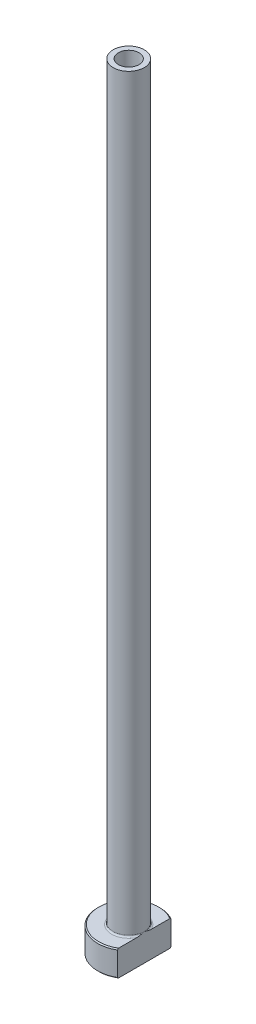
from build123d import *

# Parameters (mm, degrees)
FILLET1_R          = 0.3
CHAMFER1_SIZE      = 0.2
CUT_EXTRUDE1_DEPTH = 151.239808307
CHAMFER2_SIZE      = 0.5


with BuildPart() as part:
    # Sketch1 → Revolve1 (revolve)
    with BuildSketch(Plane.XY, mode=Mode.PRIVATE) as revolve1_sk:
        Polygon((-2, 150), (-3, 150), (-3, 5), (-6, 5), (-6, 0), (-2.25, 0), (-2.25, 93), (-2, 105), align=None)
    revolve(revolve1_sk.sketch.rotate(Axis((0, 92.187680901, 0), (0, -1, 0)), 270), axis=Axis((0, 92.187680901, 0), (0, -1, 0)))

    # Fillet1
    fillet1_edges = [part.edges().sort_by_distance(p)[0] for p in [
        (0, 5, -3),
    ]]
    fillet(fillet1_edges, radius=FILLET1_R)

    # Chamfer1
    chamfer1_edges = [part.edges().sort_by_distance(p)[0] for p in [
        (0, 0, -6),
        (0, 5, -6),
    ]]
    chamfer(chamfer1_edges, length=CHAMFER1_SIZE)

    # Sketch2 → Cut-Extrude1 (cut, through all)
    with BuildSketch(Plane.XZ):
        with BuildLine():
            Line((3, 5.196152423), (3, -5.196152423))
            ThreePointArc((3, -5.196152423), (6, 0), (3, 5.196152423))
        make_face()
    extrude(amount=-CUT_EXTRUDE1_DEPTH, mode=Mode.SUBTRACT)

    # Chamfer2
    chamfer2_edges = [part.edges().sort_by_distance(p)[0] for p in [
        (0, 0, -2.25),
    ]]
    chamfer(chamfer2_edges, length=CHAMFER2_SIZE)


solid = part.part
